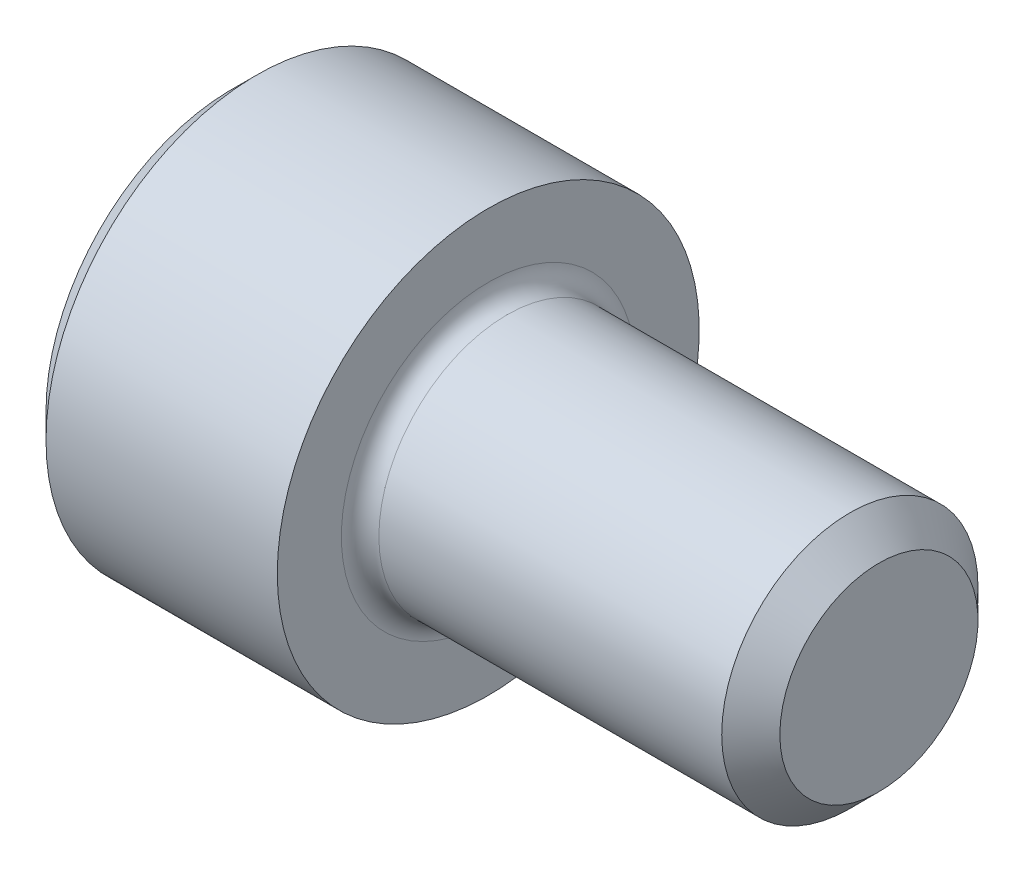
ISO-10303-21;
HEADER;
FILE_DESCRIPTION(('STEP AP214'),'2;1');
FILE_NAME('part.step','',(''),(''),'','','');
FILE_SCHEMA(('AUTOMOTIVE_DESIGN { 1 0 10303 214 1 1 1 1 }'));
ENDSEC;
DATA;
#1=APPLICATION_CONTEXT('core data for automotive mechanical design processes');
#2=APPLICATION_PROTOCOL_DEFINITION('international standard','automotive_design',2000,#1);
#3=PRODUCT_CONTEXT('',#1,'mechanical');
#4=PRODUCT('Part','Part','',(#3));
#5=PRODUCT_RELATED_PRODUCT_CATEGORY('part','',(#4));
#6=PRODUCT_DEFINITION_FORMATION('','',#4);
#7=PRODUCT_DEFINITION_CONTEXT('part definition',#1,'design');
#8=PRODUCT_DEFINITION('design','',#6,#7);
#9=PRODUCT_DEFINITION_SHAPE('','',#8);
#10=(LENGTH_UNIT() NAMED_UNIT(*) SI_UNIT(.MILLI.,.METRE.));
#11=(NAMED_UNIT(*) PLANE_ANGLE_UNIT() SI_UNIT($,.RADIAN.));
#12=(NAMED_UNIT(*) SI_UNIT($,.STERADIAN.) SOLID_ANGLE_UNIT());
#13=UNCERTAINTY_MEASURE_WITH_UNIT(LENGTH_MEASURE(1.E-05),#10,'distance_accuracy_value','');
#14=(GEOMETRIC_REPRESENTATION_CONTEXT(3) GLOBAL_UNCERTAINTY_ASSIGNED_CONTEXT((#13)) GLOBAL_UNIT_ASSIGNED_CONTEXT((#10,
#11,#12)) REPRESENTATION_CONTEXT('',''));
#15=CARTESIAN_POINT('',(0.,0.,0.));
#16=DIRECTION('',(0.,0.,1.));
#17=DIRECTION('',(1.,0.,0.));
#18=AXIS2_PLACEMENT_3D('',#15,#16,#17);
#19=CARTESIAN_POINT('',(0.,0.,0.));
#20=DIRECTION('',(-1.,0.,0.));
#21=DIRECTION('',(0.,0.,1.));
#22=AXIS2_PLACEMENT_3D('',#19,#20,#21);
#23=PLANE('',#22);
#24=DIRECTION('',(0.,-0.5,0.86602540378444));
#25=VECTOR('',#24,1.);
#26=CARTESIAN_POINT('',(0.,2.05305755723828,0.));
#27=LINE('',#26,#25);
#28=CARTESIAN_POINT('',(0.,2.05305755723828,0.));
#29=VERTEX_POINT('',#28);
#30=CARTESIAN_POINT('',(0.,1.02652877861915,1.7779999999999));
#31=VERTEX_POINT('',#30);
#32=EDGE_CURVE('E261',#29,#31,#27,.T.);
#33=ORIENTED_EDGE('',*,*,#32,.T.);
#34=DIRECTION('',(0.,1.,0.));
#35=VECTOR('',#34,1.);
#36=CARTESIAN_POINT('',(0.,-1.02652877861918,1.77799999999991));
#37=LINE('',#36,#35);
#38=CARTESIAN_POINT('',(0.,-1.02652877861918,1.77799999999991));
#39=VERTEX_POINT('',#38);
#40=EDGE_CURVE('E132',#39,#31,#37,.T.);
#41=ORIENTED_EDGE('',*,*,#40,.F.);
#42=DIRECTION('',(0.,-0.500000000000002,-0.866025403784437));
#43=VECTOR('',#42,1.);
#44=CARTESIAN_POINT('',(0.,-1.02652877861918,1.77799999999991));
#45=LINE('',#44,#43);
#46=CARTESIAN_POINT('',(0.,-2.05305755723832,0.));
#47=VERTEX_POINT('',#46);
#48=EDGE_CURVE('E264',#39,#47,#45,.T.);
#49=ORIENTED_EDGE('',*,*,#48,.T.);
#50=DIRECTION('',(0.,0.499999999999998,-0.86602540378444));
#51=VECTOR('',#50,1.);
#52=CARTESIAN_POINT('',(0.,-2.05305755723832,0.));
#53=LINE('',#52,#51);
#54=CARTESIAN_POINT('',(0.,-1.02652877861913,-1.77800000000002));
#55=VERTEX_POINT('',#54);
#56=EDGE_CURVE('E267',#47,#55,#53,.T.);
#57=ORIENTED_EDGE('',*,*,#56,.T.);
#58=DIRECTION('',(0.,-1.,0.));
#59=VECTOR('',#58,1.);
#60=CARTESIAN_POINT('',(0.,1.02652877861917,-1.77800000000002));
#61=LINE('',#60,#59);
#62=CARTESIAN_POINT('',(0.,1.02652877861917,-1.77800000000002));
#63=VERTEX_POINT('',#62);
#64=EDGE_CURVE('E270',#63,#55,#61,.T.);
#65=ORIENTED_EDGE('',*,*,#64,.F.);
#66=DIRECTION('',(0.,-0.500000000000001,-0.866025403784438));
#67=VECTOR('',#66,1.);
#68=CARTESIAN_POINT('',(0.,2.05305755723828,0.));
#69=LINE('',#68,#67);
#70=EDGE_CURVE('E127',#29,#63,#69,.T.);
#71=ORIENTED_EDGE('',*,*,#70,.F.);
#72=EDGE_LOOP('',(#33,#41,#49,#57,#65,#71));
#73=FACE_BOUND('',#72,.T.);
#74=CARTESIAN_POINT('',(0.,0.,0.));
#75=DIRECTION('',(-1.,0.,0.));
#76=DIRECTION('',(0.,0.,1.));
#77=AXIS2_PLACEMENT_3D('',#74,#75,#76);
#78=CIRCLE('',#77,3.0226);
#79=CARTESIAN_POINT('',(0.,0.,3.0226));
#80=VERTEX_POINT('',#79);
#81=EDGE_CURVE('E156',#80,#80,#78,.T.);
#82=ORIENTED_EDGE('',*,*,#81,.T.);
#83=EDGE_LOOP('',(#82));
#84=FACE_BOUND('',#83,.T.);
#85=ADVANCED_FACE('F36',(#73,#84),#23,.T.);
#86=CARTESIAN_POINT('',(0.,0.,0.));
#87=DIRECTION('',(1.,0.,0.));
#88=DIRECTION('',(0.,0.,-1.));
#89=AXIS2_PLACEMENT_3D('',#86,#87,#88);
#90=CONICAL_SURFACE('',#89,3.0226,0.785398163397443);
#91=CARTESIAN_POINT('',(0.406400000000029,0.,0.));
#92=DIRECTION('',(-1.,0.,0.));
#93=DIRECTION('',(0.,0.,1.));
#94=AXIS2_PLACEMENT_3D('',#91,#92,#93);
#95=CIRCLE('',#94,3.429);
#96=CARTESIAN_POINT('',(0.406400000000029,0.,3.42899999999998));
#97=VERTEX_POINT('',#96);
#98=EDGE_CURVE('E153',#97,#97,#95,.T.);
#99=ORIENTED_EDGE('',*,*,#98,.T.);
#100=EDGE_LOOP('',(#99));
#101=FACE_BOUND('',#100,.T.);
#102=ORIENTED_EDGE('',*,*,#81,.F.);
#103=EDGE_LOOP('',(#102));
#104=FACE_BOUND('',#103,.T.);
#105=ADVANCED_FACE('F177',(#101,#104),#90,.T.);
#106=CARTESIAN_POINT('',(-31.7500000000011,1.11022302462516E-13,0.));
#107=DIRECTION('',(-1.,0.,0.));
#108=DIRECTION('',(0.,0.,1.));
#109=AXIS2_PLACEMENT_3D('',#106,#107,#108);
#110=CYLINDRICAL_SURFACE('',#109,3.429);
#111=CARTESIAN_POINT('',(4.16559999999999,1.2490009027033E-13,-1.11022302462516E-13));
#112=DIRECTION('',(-1.,0.,0.));
#113=DIRECTION('',(0.,0.,1.));
#114=AXIS2_PLACEMENT_3D('',#111,#112,#113);
#115=CIRCLE('',#114,3.429);
#116=CARTESIAN_POINT('',(4.16559999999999,1.2490009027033E-13,3.42899999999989));
#117=VERTEX_POINT('',#116);
#118=EDGE_CURVE('E150',#117,#117,#115,.T.);
#119=ORIENTED_EDGE('',*,*,#118,.T.);
#120=EDGE_LOOP('',(#119));
#121=FACE_BOUND('',#120,.T.);
#122=ORIENTED_EDGE('',*,*,#98,.F.);
#123=EDGE_LOOP('',(#122));
#124=FACE_BOUND('',#123,.T.);
#125=ADVANCED_FACE('F182',(#121,#124),#110,.T.);
#126=CARTESIAN_POINT('',(4.16559999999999,3.42900000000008,0.));
#127=DIRECTION('',(1.,0.,0.));
#128=DIRECTION('',(0.,0.,-1.));
#129=AXIS2_PLACEMENT_3D('',#126,#127,#128);
#130=PLANE('',#129);
#131=CARTESIAN_POINT('',(4.16559999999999,1.2490009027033E-13,-1.11022302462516E-13));
#132=DIRECTION('',(1.,0.,0.));
#133=DIRECTION('',(0.,0.,-1.));
#134=AXIS2_PLACEMENT_3D('',#131,#132,#133);
#135=CIRCLE('',#134,2.3876);
#136=CARTESIAN_POINT('',(4.16559999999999,1.2490009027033E-13,-2.38760000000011));
#137=VERTEX_POINT('',#136);
#138=EDGE_CURVE('E44',#137,#137,#135,.F.);
#139=ORIENTED_EDGE('',*,*,#138,.T.);
#140=EDGE_LOOP('',(#139));
#141=FACE_BOUND('',#140,.T.);
#142=ORIENTED_EDGE('',*,*,#118,.F.);
#143=EDGE_LOOP('',(#142));
#144=FACE_BOUND('',#143,.T.);
#145=ADVANCED_FACE('F161',(#141,#144),#130,.T.);
#146=CARTESIAN_POINT('',(-31.7500000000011,1.11022302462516E-13,0.));
#147=DIRECTION('',(-1.,0.,0.));
#148=DIRECTION('',(0.,0.,1.));
#149=AXIS2_PLACEMENT_3D('',#146,#147,#148);
#150=CYLINDRICAL_SURFACE('',#149,2.0828);
#151=CARTESIAN_POINT('',(4.47039999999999,0.,0.));
#152=DIRECTION('',(1.,0.,0.));
#153=DIRECTION('',(0.,0.,-1.));
#154=AXIS2_PLACEMENT_3D('',#151,#152,#153);
#155=CIRCLE('',#154,2.0828);
#156=CARTESIAN_POINT('',(4.47039999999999,0.,-2.08280000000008));
#157=VERTEX_POINT('',#156);
#158=EDGE_CURVE('E11',#157,#157,#155,.T.);
#159=ORIENTED_EDGE('',*,*,#158,.T.);
#160=EDGE_LOOP('',(#159));
#161=FACE_BOUND('',#160,.T.);
#162=CARTESIAN_POINT('',(10.0431600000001,0.,0.));
#163=DIRECTION('',(-1.,0.,0.));
#164=DIRECTION('',(0.,0.,1.));
#165=AXIS2_PLACEMENT_3D('',#162,#163,#164);
#166=CIRCLE('',#165,2.0828);
#167=CARTESIAN_POINT('',(10.0431600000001,0.,2.08279999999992));
#168=VERTEX_POINT('',#167);
#169=EDGE_CURVE('E147',#168,#168,#166,.T.);
#170=ORIENTED_EDGE('',*,*,#169,.T.);
#171=EDGE_LOOP('',(#170));
#172=FACE_BOUND('',#171,.T.);
#173=ADVANCED_FACE('F192',(#161,#172),#150,.T.);
#174=CARTESIAN_POINT('',(10.5156,0.,0.));
#175=DIRECTION('',(-1.,0.,0.));
#176=DIRECTION('',(0.,0.,1.));
#177=AXIS2_PLACEMENT_3D('',#174,#175,#176);
#178=CONICAL_SURFACE('',#177,1.61036,0.785398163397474);
#179=ORIENTED_EDGE('',*,*,#169,.F.);
#180=EDGE_LOOP('',(#179));
#181=FACE_BOUND('',#180,.T.);
#182=CARTESIAN_POINT('',(10.5156,0.,0.));
#183=DIRECTION('',(-1.,0.,0.));
#184=DIRECTION('',(0.,0.,1.));
#185=AXIS2_PLACEMENT_3D('',#182,#183,#184);
#186=CIRCLE('',#185,1.61036);
#187=CARTESIAN_POINT('',(10.5156,0.,1.61035999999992));
#188=VERTEX_POINT('',#187);
#189=EDGE_CURVE('E143',#188,#188,#186,.T.);
#190=ORIENTED_EDGE('',*,*,#189,.T.);
#191=EDGE_LOOP('',(#190));
#192=FACE_BOUND('',#191,.T.);
#193=ADVANCED_FACE('F172',(#181,#192),#178,.T.);
#194=CARTESIAN_POINT('',(10.5156,1.61036000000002,0.));
#195=DIRECTION('',(1.,0.,0.));
#196=DIRECTION('',(0.,0.,-1.));
#197=AXIS2_PLACEMENT_3D('',#194,#195,#196);
#198=PLANE('',#197);
#199=ORIENTED_EDGE('',*,*,#189,.F.);
#200=EDGE_LOOP('',(#199));
#201=FACE_BOUND('',#200,.T.);
#202=ADVANCED_FACE('F165',(#201),#198,.T.);
#203=CARTESIAN_POINT('',(4.47039999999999,0.,0.));
#204=DIRECTION('',(1.,0.,0.));
#205=DIRECTION('',(0.,0.,-1.));
#206=AXIS2_PLACEMENT_3D('',#203,#204,#205);
#207=TOROIDAL_SURFACE('',#206,2.3876,0.3048);
#208=ORIENTED_EDGE('',*,*,#158,.F.);
#209=EDGE_LOOP('',(#208));
#210=FACE_BOUND('',#209,.T.);
#211=ORIENTED_EDGE('',*,*,#138,.F.);
#212=EDGE_LOOP('',(#211));
#213=FACE_BOUND('',#212,.T.);
#214=ADVANCED_FACE('F38',(#210,#213),#207,.F.);
#215=CARTESIAN_POINT('',(1.95580000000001,2.05305755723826,0.));
#216=DIRECTION('',(0.,-0.86602540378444,-0.499999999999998));
#217=DIRECTION('',(0.,0.499999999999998,-0.86602540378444));
#218=AXIS2_PLACEMENT_3D('',#215,#216,#217);
#219=PLANE('',#218);
#220=ORIENTED_EDGE('',*,*,#32,.F.);
#221=DIRECTION('',(-1.,0.,0.));
#222=VECTOR('',#221,1.);
#223=CARTESIAN_POINT('',(1.95580000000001,2.05305755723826,0.));
#224=LINE('',#223,#222);
#225=CARTESIAN_POINT('',(1.95580000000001,2.05305755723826,0.));
#226=VERTEX_POINT('',#225);
#227=EDGE_CURVE('E251',#226,#29,#224,.T.);
#228=ORIENTED_EDGE('',*,*,#227,.F.);
#229=DIRECTION('',(0.,-0.5,0.86602540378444));
#230=VECTOR('',#229,1.);
#231=CARTESIAN_POINT('',(1.95580000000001,2.05305755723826,0.));
#232=LINE('',#231,#230);
#233=CARTESIAN_POINT('',(1.95580000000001,1.53979316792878,0.888999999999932));
#234=VERTEX_POINT('',#233);
#235=EDGE_CURVE('E119',#226,#234,#232,.T.);
#236=ORIENTED_EDGE('',*,*,#235,.T.);
#237=CARTESIAN_POINT('',(1.95580000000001,1.02652877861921,1.77799999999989));
#238=VERTEX_POINT('',#237);
#239=EDGE_CURVE('E110',#234,#238,#232,.T.);
#240=ORIENTED_EDGE('',*,*,#239,.T.);
#241=DIRECTION('',(-1.,0.,0.));
#242=VECTOR('',#241,1.);
#243=CARTESIAN_POINT('',(1.95580000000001,1.02652877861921,1.77799999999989));
#244=LINE('',#243,#242);
#245=EDGE_CURVE('E124',#238,#31,#244,.T.);
#246=ORIENTED_EDGE('',*,*,#245,.T.);
#247=EDGE_LOOP('',(#220,#228,#236,#240,#246));
#248=FACE_BOUND('',#247,.T.);
#249=ADVANCED_FACE('F123',(#248),#219,.T.);
#250=CARTESIAN_POINT('',(1.95580000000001,-1.02652877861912,1.7779999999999));
#251=DIRECTION('',(0.,0.,1.));
#252=DIRECTION('',(0.,-1.,0.));
#253=AXIS2_PLACEMENT_3D('',#250,#251,#252);
#254=PLANE('',#253);
#255=ORIENTED_EDGE('',*,*,#40,.T.);
#256=ORIENTED_EDGE('',*,*,#245,.F.);
#257=DIRECTION('',(0.,1.,0.));
#258=VECTOR('',#257,1.);
#259=CARTESIAN_POINT('',(1.95580000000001,-1.02652877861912,1.7779999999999));
#260=LINE('',#259,#258);
#261=CARTESIAN_POINT('',(1.95580000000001,0.,1.778));
#262=VERTEX_POINT('',#261);
#263=EDGE_CURVE('E107',#262,#238,#260,.T.);
#264=ORIENTED_EDGE('',*,*,#263,.F.);
#265=CARTESIAN_POINT('',(1.95580000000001,-1.02652877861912,1.7779999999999));
#266=VERTEX_POINT('',#265);
#267=EDGE_CURVE('E118',#266,#262,#260,.T.);
#268=ORIENTED_EDGE('',*,*,#267,.F.);
#269=DIRECTION('',(-1.,0.,0.));
#270=VECTOR('',#269,1.);
#271=CARTESIAN_POINT('',(1.95580000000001,-1.02652877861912,1.7779999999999));
#272=LINE('',#271,#270);
#273=EDGE_CURVE('E134',#266,#39,#272,.T.);
#274=ORIENTED_EDGE('',*,*,#273,.T.);
#275=EDGE_LOOP('',(#255,#256,#264,#268,#274));
#276=FACE_BOUND('',#275,.T.);
#277=ADVANCED_FACE('F129',(#276),#254,.F.);
#278=CARTESIAN_POINT('',(1.95580000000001,-1.02652877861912,1.7779999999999));
#279=DIRECTION('',(0.,0.866025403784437,-0.500000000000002));
#280=DIRECTION('',(0.,0.500000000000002,0.866025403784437));
#281=AXIS2_PLACEMENT_3D('',#278,#279,#280);
#282=PLANE('',#281);
#283=ORIENTED_EDGE('',*,*,#48,.F.);
#284=ORIENTED_EDGE('',*,*,#273,.F.);
#285=DIRECTION('',(0.,-0.500000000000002,-0.866025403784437));
#286=VECTOR('',#285,1.);
#287=CARTESIAN_POINT('',(1.95580000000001,-1.02652877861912,1.7779999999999));
#288=LINE('',#287,#286);
#289=CARTESIAN_POINT('',(1.95580000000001,-1.5397931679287,0.888999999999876));
#290=VERTEX_POINT('',#289);
#291=EDGE_CURVE('E290',#266,#290,#288,.T.);
#292=ORIENTED_EDGE('',*,*,#291,.T.);
#293=CARTESIAN_POINT('',(1.95580000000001,-2.05305755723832,0.));
#294=VERTEX_POINT('',#293);
#295=EDGE_CURVE('E279',#290,#294,#288,.T.);
#296=ORIENTED_EDGE('',*,*,#295,.T.);
#297=DIRECTION('',(-1.,0.,0.));
#298=VECTOR('',#297,1.);
#299=CARTESIAN_POINT('',(1.95580000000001,-2.05305755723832,0.));
#300=LINE('',#299,#298);
#301=EDGE_CURVE('E139',#294,#47,#300,.T.);
#302=ORIENTED_EDGE('',*,*,#301,.T.);
#303=EDGE_LOOP('',(#283,#284,#292,#296,#302));
#304=FACE_BOUND('',#303,.T.);
#305=ADVANCED_FACE('F205',(#304),#282,.T.);
#306=CARTESIAN_POINT('',(1.95580000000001,-2.05305755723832,0.));
#307=DIRECTION('',(0.,0.86602540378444,0.499999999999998));
#308=DIRECTION('',(0.,-0.499999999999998,0.86602540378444));
#309=AXIS2_PLACEMENT_3D('',#306,#307,#308);
#310=PLANE('',#309);
#311=ORIENTED_EDGE('',*,*,#56,.F.);
#312=ORIENTED_EDGE('',*,*,#301,.F.);
#313=DIRECTION('',(0.,0.499999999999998,-0.86602540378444));
#314=VECTOR('',#313,1.);
#315=CARTESIAN_POINT('',(1.95580000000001,-2.05305755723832,0.));
#316=LINE('',#315,#314);
#317=CARTESIAN_POINT('',(1.95580000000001,-1.53979316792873,-0.888999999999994));
#318=VERTEX_POINT('',#317);
#319=EDGE_CURVE('E257',#294,#318,#316,.T.);
#320=ORIENTED_EDGE('',*,*,#319,.T.);
#321=CARTESIAN_POINT('',(1.95580000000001,-1.02652877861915,-1.77800000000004));
#322=VERTEX_POINT('',#321);
#323=EDGE_CURVE('E289',#318,#322,#316,.T.);
#324=ORIENTED_EDGE('',*,*,#323,.T.);
#325=DIRECTION('',(-1.,0.,0.));
#326=VECTOR('',#325,1.);
#327=CARTESIAN_POINT('',(1.95580000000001,-1.02652877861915,-1.77800000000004));
#328=LINE('',#327,#326);
#329=EDGE_CURVE('E250',#322,#55,#328,.T.);
#330=ORIENTED_EDGE('',*,*,#329,.T.);
#331=EDGE_LOOP('',(#311,#312,#320,#324,#330));
#332=FACE_BOUND('',#331,.T.);
#333=ADVANCED_FACE('F208',(#332),#310,.T.);
#334=CARTESIAN_POINT('',(1.95580000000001,1.02652877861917,-1.77800000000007));
#335=DIRECTION('',(0.,0.,-1.));
#336=DIRECTION('',(0.,1.,0.));
#337=AXIS2_PLACEMENT_3D('',#334,#335,#336);
#338=PLANE('',#337);
#339=ORIENTED_EDGE('',*,*,#64,.T.);
#340=ORIENTED_EDGE('',*,*,#329,.F.);
#341=DIRECTION('',(0.,-1.,0.));
#342=VECTOR('',#341,1.);
#343=CARTESIAN_POINT('',(1.95580000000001,1.02652877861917,-1.77800000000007));
#344=LINE('',#343,#342);
#345=CARTESIAN_POINT('',(1.95580000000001,0.,-1.77800000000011));
#346=VERTEX_POINT('',#345);
#347=EDGE_CURVE('E254',#346,#322,#344,.T.);
#348=ORIENTED_EDGE('',*,*,#347,.F.);
#349=CARTESIAN_POINT('',(1.95580000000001,1.02652877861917,-1.77800000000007));
#350=VERTEX_POINT('',#349);
#351=EDGE_CURVE('E51',#350,#346,#344,.T.);
#352=ORIENTED_EDGE('',*,*,#351,.F.);
#353=DIRECTION('',(-1.,0.,0.));
#354=VECTOR('',#353,1.);
#355=CARTESIAN_POINT('',(1.95580000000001,1.02652877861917,-1.77800000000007));
#356=LINE('',#355,#354);
#357=EDGE_CURVE('E247',#350,#63,#356,.T.);
#358=ORIENTED_EDGE('',*,*,#357,.T.);
#359=EDGE_LOOP('',(#339,#340,#348,#352,#358));
#360=FACE_BOUND('',#359,.T.);
#361=ADVANCED_FACE('F212',(#360),#338,.F.);
#362=CARTESIAN_POINT('',(1.95580000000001,2.05305755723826,0.));
#363=DIRECTION('',(0.,0.866025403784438,-0.500000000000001));
#364=DIRECTION('',(0.,0.500000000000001,0.866025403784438));
#365=AXIS2_PLACEMENT_3D('',#362,#363,#364);
#366=PLANE('',#365);
#367=ORIENTED_EDGE('',*,*,#70,.T.);
#368=ORIENTED_EDGE('',*,*,#357,.F.);
#369=DIRECTION('',(0.,-0.500000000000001,-0.866025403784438));
#370=VECTOR('',#369,1.);
#371=CARTESIAN_POINT('',(1.95580000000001,2.05305755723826,0.));
#372=LINE('',#371,#370);
#373=CARTESIAN_POINT('',(1.95580000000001,1.53979316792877,-0.88900000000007));
#374=VERTEX_POINT('',#373);
#375=EDGE_CURVE('E237',#374,#350,#372,.T.);
#376=ORIENTED_EDGE('',*,*,#375,.F.);
#377=EDGE_CURVE('E243',#226,#374,#372,.T.);
#378=ORIENTED_EDGE('',*,*,#377,.F.);
#379=ORIENTED_EDGE('',*,*,#227,.T.);
#380=EDGE_LOOP('',(#367,#368,#376,#378,#379));
#381=FACE_BOUND('',#380,.T.);
#382=ADVANCED_FACE('F216',(#381),#366,.F.);
#383=CARTESIAN_POINT('',(1.95580000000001,3.07958633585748,-1.77800000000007));
#384=DIRECTION('',(1.,0.,0.));
#385=DIRECTION('',(0.,0.,-1.));
#386=AXIS2_PLACEMENT_3D('',#383,#384,#385);
#387=PLANE('',#386);
#388=ORIENTED_EDGE('',*,*,#347,.T.);
#389=ORIENTED_EDGE('',*,*,#323,.F.);
#390=CARTESIAN_POINT('',(1.95580000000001,0.,0.));
#391=DIRECTION('',(-1.,0.,0.));
#392=DIRECTION('',(0.,0.,1.));
#393=AXIS2_PLACEMENT_3D('',#390,#391,#392);
#394=CIRCLE('',#393,1.778);
#395=EDGE_CURVE('E285',#346,#318,#394,.T.);
#396=ORIENTED_EDGE('',*,*,#395,.F.);
#397=EDGE_LOOP('',(#388,#389,#396));
#398=FACE_BOUND('',#397,.T.);
#399=ADVANCED_FACE('F220',(#398),#387,.F.);
#400=ORIENTED_EDGE('',*,*,#319,.F.);
#401=ORIENTED_EDGE('',*,*,#295,.F.);
#402=EDGE_CURVE('E137',#318,#290,#394,.T.);
#403=ORIENTED_EDGE('',*,*,#402,.F.);
#404=EDGE_LOOP('',(#400,#401,#403));
#405=FACE_BOUND('',#404,.T.);
#406=ADVANCED_FACE('F223',(#405),#387,.F.);
#407=ORIENTED_EDGE('',*,*,#291,.F.);
#408=ORIENTED_EDGE('',*,*,#267,.T.);
#409=EDGE_CURVE('E133',#290,#262,#394,.T.);
#410=ORIENTED_EDGE('',*,*,#409,.F.);
#411=EDGE_LOOP('',(#407,#408,#410));
#412=FACE_BOUND('',#411,.T.);
#413=ADVANCED_FACE('F228',(#412),#387,.F.);
#414=ORIENTED_EDGE('',*,*,#263,.T.);
#415=ORIENTED_EDGE('',*,*,#239,.F.);
#416=EDGE_CURVE('E113',#262,#234,#394,.T.);
#417=ORIENTED_EDGE('',*,*,#416,.F.);
#418=EDGE_LOOP('',(#414,#415,#417));
#419=FACE_BOUND('',#418,.T.);
#420=ADVANCED_FACE('F109',(#419),#387,.F.);
#421=ORIENTED_EDGE('',*,*,#235,.F.);
#422=ORIENTED_EDGE('',*,*,#377,.T.);
#423=EDGE_CURVE('E144',#234,#374,#394,.T.);
#424=ORIENTED_EDGE('',*,*,#423,.F.);
#425=EDGE_LOOP('',(#421,#422,#424));
#426=FACE_BOUND('',#425,.T.);
#427=ADVANCED_FACE('F231',(#426),#387,.F.);
#428=ORIENTED_EDGE('',*,*,#375,.T.);
#429=ORIENTED_EDGE('',*,*,#351,.T.);
#430=EDGE_CURVE('E240',#374,#346,#394,.T.);
#431=ORIENTED_EDGE('',*,*,#430,.F.);
#432=EDGE_LOOP('',(#428,#429,#431));
#433=FACE_BOUND('',#432,.T.);
#434=ADVANCED_FACE('F201',(#433),#387,.F.);
#435=CARTESIAN_POINT('',(1.95580000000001,0.,0.));
#436=DIRECTION('',(-1.,0.,0.));
#437=DIRECTION('',(0.,0.,1.));
#438=AXIS2_PLACEMENT_3D('',#435,#436,#437);
#439=CONICAL_SURFACE('',#438,1.778,1.04719755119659);
#440=CARTESIAN_POINT('',(2.98232877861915,0.,0.));
#441=VERTEX_POINT('',#440);
#442=VERTEX_LOOP('',#441);
#443=FACE_BOUND('',#442,.T.);
#444=ORIENTED_EDGE('',*,*,#416,.T.);
#445=ORIENTED_EDGE('',*,*,#423,.T.);
#446=ORIENTED_EDGE('',*,*,#430,.T.);
#447=ORIENTED_EDGE('',*,*,#395,.T.);
#448=ORIENTED_EDGE('',*,*,#402,.T.);
#449=ORIENTED_EDGE('',*,*,#409,.T.);
#450=EDGE_LOOP('',(#444,#445,#446,#447,#448,#449));
#451=FACE_BOUND('',#450,.T.);
#452=ADVANCED_FACE('F199',(#443,#451),#439,.F.);
#453=CLOSED_SHELL('',(#85,#105,#125,#145,#173,#193,#202,#214,#249,#277,#305,#333,#361,#382,#399,
#406,#413,#420,#427,#434,#452));
#454=MANIFOLD_SOLID_BREP('B2',#453);
#455=ADVANCED_BREP_SHAPE_REPRESENTATION('',(#18,#454),#14);
#456=SHAPE_DEFINITION_REPRESENTATION(#9,#455);
ENDSEC;
END-ISO-10303-21;
